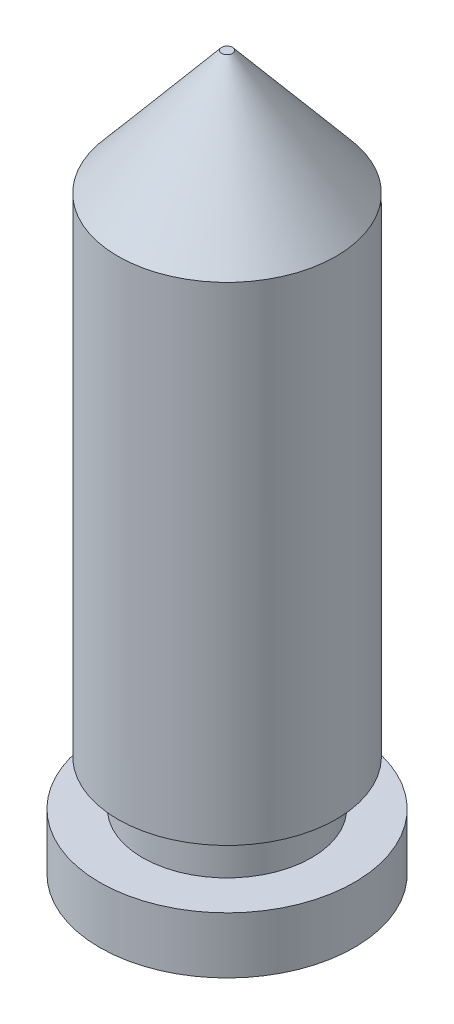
from build123d import *


with BuildPart() as part:
    # Sketch1 → Revolve1 (revolve)
    with BuildSketch(Plane.XY, mode=Mode.PRIVATE) as revolve1_sk:
        Polygon((0, 0), (1.778, 0), (1.778, 0.7874), (1.1811, 0.7874), (1.1811, 1.4224), (1.524, 1.4224), (1.524, 8.2296), (0.074707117, 9.9568), (0, 9.9568), align=None)
    revolve(revolve1_sk.sketch.rotate(Axis((0, 0, 0), (0, -1, 0)), 90), axis=Axis((0, 0, 0), (0, -1, 0)))


solid = part.part
